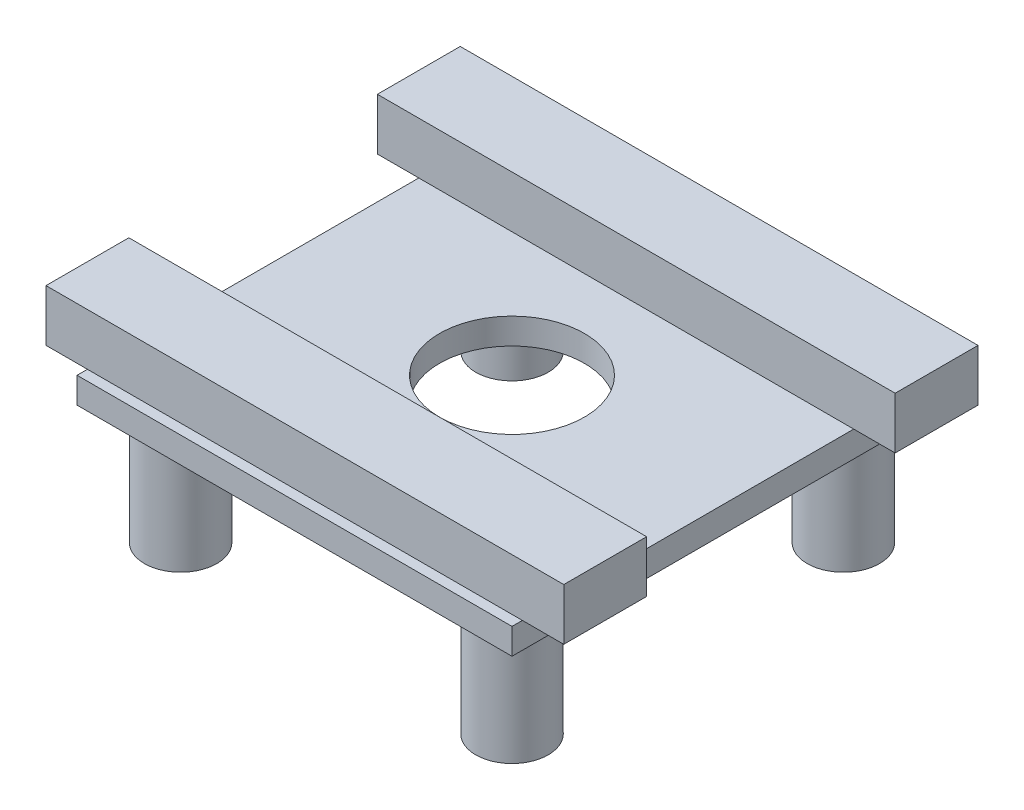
ISO-10303-21;
HEADER;
FILE_DESCRIPTION(('STEP AP214'),'2;1');
FILE_NAME('part.step','',(''),(''),'','','');
FILE_SCHEMA(('AUTOMOTIVE_DESIGN { 1 0 10303 214 1 1 1 1 }'));
ENDSEC;
DATA;
#1=APPLICATION_CONTEXT('core data for automotive mechanical design processes');
#2=APPLICATION_PROTOCOL_DEFINITION('international standard','automotive_design',2000,#1);
#3=PRODUCT_CONTEXT('',#1,'mechanical');
#4=PRODUCT('Part','Part','',(#3));
#5=PRODUCT_RELATED_PRODUCT_CATEGORY('part','',(#4));
#6=PRODUCT_DEFINITION_FORMATION('','',#4);
#7=PRODUCT_DEFINITION_CONTEXT('part definition',#1,'design');
#8=PRODUCT_DEFINITION('design','',#6,#7);
#9=PRODUCT_DEFINITION_SHAPE('','',#8);
#10=(LENGTH_UNIT() NAMED_UNIT(*) SI_UNIT(.MILLI.,.METRE.));
#11=(NAMED_UNIT(*) PLANE_ANGLE_UNIT() SI_UNIT($,.RADIAN.));
#12=(NAMED_UNIT(*) SI_UNIT($,.STERADIAN.) SOLID_ANGLE_UNIT());
#13=UNCERTAINTY_MEASURE_WITH_UNIT(LENGTH_MEASURE(1.E-05),#10,'distance_accuracy_value','');
#14=(GEOMETRIC_REPRESENTATION_CONTEXT(3) GLOBAL_UNCERTAINTY_ASSIGNED_CONTEXT((#13)) GLOBAL_UNIT_ASSIGNED_CONTEXT((#10,
#11,#12)) REPRESENTATION_CONTEXT('',''));
#15=CARTESIAN_POINT('',(0.,0.,0.));
#16=DIRECTION('',(0.,0.,1.));
#17=DIRECTION('',(1.,0.,0.));
#18=AXIS2_PLACEMENT_3D('',#15,#16,#17);
#19=CARTESIAN_POINT('',(0.,0.,0.));
#20=DIRECTION('',(0.,-1.,0.));
#21=DIRECTION('',(0.,0.,-1.));
#22=AXIS2_PLACEMENT_3D('',#19,#20,#21);
#23=PLANE('',#22);
#24=DIRECTION('',(-1.,0.,0.));
#25=VECTOR('',#24,1.);
#26=CARTESIAN_POINT('',(-50000.,0.,-40000.));
#27=LINE('',#26,#25);
#28=CARTESIAN_POINT('',(42000.,0.,-40000.));
#29=VERTEX_POINT('',#28);
#30=CARTESIAN_POINT('',(-42000.,0.,-40000.));
#31=VERTEX_POINT('',#30);
#32=EDGE_CURVE('E11',#29,#31,#27,.T.);
#33=ORIENTED_EDGE('',*,*,#32,.F.);
#34=DIRECTION('',(0.,0.,-1.));
#35=VECTOR('',#34,1.);
#36=CARTESIAN_POINT('',(42000.,0.,42000.));
#37=LINE('',#36,#35);
#38=CARTESIAN_POINT('',(42000.,0.,-42000.));
#39=VERTEX_POINT('',#38);
#40=EDGE_CURVE('E212',#29,#39,#37,.T.);
#41=ORIENTED_EDGE('',*,*,#40,.T.);
#42=DIRECTION('',(-1.,0.,0.));
#43=VECTOR('',#42,1.);
#44=CARTESIAN_POINT('',(-42000.,0.,-42000.));
#45=LINE('',#44,#43);
#46=CARTESIAN_POINT('',(-42000.,0.,-42000.));
#47=VERTEX_POINT('',#46);
#48=EDGE_CURVE('E197',#39,#47,#45,.T.);
#49=ORIENTED_EDGE('',*,*,#48,.T.);
#50=DIRECTION('',(0.,0.,1.));
#51=VECTOR('',#50,1.);
#52=CARTESIAN_POINT('',(-42000.,0.,42000.));
#53=LINE('',#52,#51);
#54=EDGE_CURVE('E210',#47,#31,#53,.T.);
#55=ORIENTED_EDGE('',*,*,#54,.T.);
#56=EDGE_LOOP('',(#33,#41,#49,#55));
#57=FACE_BOUND('',#56,.T.);
#58=ADVANCED_FACE('F39',(#57),#23,.F.);
#59=CARTESIAN_POINT('',(0.,0.,0.));
#60=DIRECTION('',(0.,1.,0.));
#61=DIRECTION('',(0.,0.,1.));
#62=AXIS2_PLACEMENT_3D('',#59,#60,#61);
#63=CIRCLE('',#62,14000.);
#64=CARTESIAN_POINT('',(0.,0.,14000.));
#65=VERTEX_POINT('',#64);
#66=EDGE_CURVE('E182',#65,#65,#63,.T.);
#67=ORIENTED_EDGE('',*,*,#66,.F.);
#68=EDGE_LOOP('',(#67));
#69=FACE_BOUND('',#68,.T.);
#70=DIRECTION('',(1.,0.,0.));
#71=VECTOR('',#70,1.);
#72=CARTESIAN_POINT('',(-50000.,0.,-24000.));
#73=LINE('',#72,#71);
#74=CARTESIAN_POINT('',(-42000.,0.,-24000.));
#75=VERTEX_POINT('',#74);
#76=CARTESIAN_POINT('',(42000.,0.,-24000.));
#77=VERTEX_POINT('',#76);
#78=EDGE_CURVE('E48',#75,#77,#73,.T.);
#79=ORIENTED_EDGE('',*,*,#78,.F.);
#80=CARTESIAN_POINT('',(-42000.,0.,24000.));
#81=VERTEX_POINT('',#80);
#82=EDGE_CURVE('E209',#75,#81,#53,.T.);
#83=ORIENTED_EDGE('',*,*,#82,.T.);
#84=DIRECTION('',(-1.,0.,0.));
#85=VECTOR('',#84,1.);
#86=CARTESIAN_POINT('',(-50000.,0.,24000.));
#87=LINE('',#86,#85);
#88=CARTESIAN_POINT('',(42000.,0.,24000.));
#89=VERTEX_POINT('',#88);
#90=EDGE_CURVE('E238',#89,#81,#87,.T.);
#91=ORIENTED_EDGE('',*,*,#90,.F.);
#92=EDGE_CURVE('E369',#89,#77,#37,.T.);
#93=ORIENTED_EDGE('',*,*,#92,.T.);
#94=EDGE_LOOP('',(#79,#83,#91,#93));
#95=FACE_BOUND('',#94,.T.);
#96=ADVANCED_FACE('F317',(#69,#95),#23,.F.);
#97=CARTESIAN_POINT('',(0.,0.,0.));
#98=DIRECTION('',(0.,-1.,0.));
#99=DIRECTION('',(0.,0.,-1.));
#100=AXIS2_PLACEMENT_3D('',#97,#98,#99);
#101=PLANE('',#100);
#102=CARTESIAN_POINT('',(-50000.,0.,24000.));
#103=VERTEX_POINT('',#102);
#104=EDGE_CURVE('E263',#81,#103,#87,.T.);
#105=ORIENTED_EDGE('',*,*,#104,.F.);
#106=CARTESIAN_POINT('',(-42000.,0.,40000.));
#107=VERTEX_POINT('',#106);
#108=EDGE_CURVE('E211',#81,#107,#53,.T.);
#109=ORIENTED_EDGE('',*,*,#108,.T.);
#110=DIRECTION('',(1.,0.,0.));
#111=VECTOR('',#110,1.);
#112=CARTESIAN_POINT('',(-50000.,0.,40000.));
#113=LINE('',#112,#111);
#114=CARTESIAN_POINT('',(-50000.,0.,40000.));
#115=VERTEX_POINT('',#114);
#116=EDGE_CURVE('E256',#115,#107,#113,.T.);
#117=ORIENTED_EDGE('',*,*,#116,.F.);
#118=DIRECTION('',(0.,0.,1.));
#119=VECTOR('',#118,1.);
#120=CARTESIAN_POINT('',(-50000.,0.,40000.));
#121=LINE('',#120,#119);
#122=EDGE_CURVE('E242',#103,#115,#121,.T.);
#123=ORIENTED_EDGE('',*,*,#122,.F.);
#124=EDGE_LOOP('',(#105,#109,#117,#123));
#125=FACE_BOUND('',#124,.T.);
#126=ADVANCED_FACE('F330',(#125),#101,.T.);
#127=CARTESIAN_POINT('',(42000.,0.,40000.));
#128=VERTEX_POINT('',#127);
#129=CARTESIAN_POINT('',(50000.,0.,40000.));
#130=VERTEX_POINT('',#129);
#131=EDGE_CURVE('E260',#128,#130,#113,.T.);
#132=ORIENTED_EDGE('',*,*,#131,.F.);
#133=EDGE_CURVE('E217',#128,#89,#37,.T.);
#134=ORIENTED_EDGE('',*,*,#133,.T.);
#135=CARTESIAN_POINT('',(50000.,0.,24000.));
#136=VERTEX_POINT('',#135);
#137=EDGE_CURVE('E249',#136,#89,#87,.T.);
#138=ORIENTED_EDGE('',*,*,#137,.F.);
#139=DIRECTION('',(0.,0.,-1.));
#140=VECTOR('',#139,1.);
#141=CARTESIAN_POINT('',(50000.,0.,40000.));
#142=LINE('',#141,#140);
#143=EDGE_CURVE('E261',#130,#136,#142,.T.);
#144=ORIENTED_EDGE('',*,*,#143,.F.);
#145=EDGE_LOOP('',(#132,#134,#138,#144));
#146=FACE_BOUND('',#145,.T.);
#147=ADVANCED_FACE('F375',(#146),#101,.T.);
#148=CARTESIAN_POINT('',(-50000.,10000.,40000.));
#149=DIRECTION('',(1.,0.,0.));
#150=DIRECTION('',(0.,0.,-1.));
#151=AXIS2_PLACEMENT_3D('',#148,#149,#150);
#152=PLANE('',#151);
#153=ORIENTED_EDGE('',*,*,#122,.T.);
#154=DIRECTION('',(0.,-1.,0.));
#155=VECTOR('',#154,1.);
#156=CARTESIAN_POINT('',(-50000.,10000.,40000.));
#157=LINE('',#156,#155);
#158=CARTESIAN_POINT('',(-50000.,10000.,40000.));
#159=VERTEX_POINT('',#158);
#160=EDGE_CURVE('E273',#159,#115,#157,.T.);
#161=ORIENTED_EDGE('',*,*,#160,.F.);
#162=DIRECTION('',(0.,0.,1.));
#163=VECTOR('',#162,1.);
#164=CARTESIAN_POINT('',(-50000.,10000.,40000.));
#165=LINE('',#164,#163);
#166=CARTESIAN_POINT('',(-50000.,10000.,24000.));
#167=VERTEX_POINT('',#166);
#168=EDGE_CURVE('E245',#167,#159,#165,.T.);
#169=ORIENTED_EDGE('',*,*,#168,.F.);
#170=DIRECTION('',(0.,-1.,0.));
#171=VECTOR('',#170,1.);
#172=CARTESIAN_POINT('',(-50000.,10000.,24000.));
#173=LINE('',#172,#171);
#174=EDGE_CURVE('E255',#167,#103,#173,.T.);
#175=ORIENTED_EDGE('',*,*,#174,.T.);
#176=EDGE_LOOP('',(#153,#161,#169,#175));
#177=FACE_BOUND('',#176,.T.);
#178=ADVANCED_FACE('F41',(#177),#152,.F.);
#179=CARTESIAN_POINT('',(-50000.,10000.,40000.));
#180=DIRECTION('',(0.,0.,-1.));
#181=DIRECTION('',(-1.,0.,0.));
#182=AXIS2_PLACEMENT_3D('',#179,#180,#181);
#183=PLANE('',#182);
#184=ORIENTED_EDGE('',*,*,#116,.T.);
#185=EDGE_CURVE('E224',#107,#128,#113,.T.);
#186=ORIENTED_EDGE('',*,*,#185,.T.);
#187=ORIENTED_EDGE('',*,*,#131,.T.);
#188=DIRECTION('',(0.,-1.,0.));
#189=VECTOR('',#188,1.);
#190=CARTESIAN_POINT('',(50000.,10000.,40000.));
#191=LINE('',#190,#189);
#192=CARTESIAN_POINT('',(50000.,10000.,40000.));
#193=VERTEX_POINT('',#192);
#194=EDGE_CURVE('E271',#193,#130,#191,.T.);
#195=ORIENTED_EDGE('',*,*,#194,.F.);
#196=DIRECTION('',(1.,0.,0.));
#197=VECTOR('',#196,1.);
#198=CARTESIAN_POINT('',(-50000.,10000.,40000.));
#199=LINE('',#198,#197);
#200=EDGE_CURVE('E250',#159,#193,#199,.T.);
#201=ORIENTED_EDGE('',*,*,#200,.F.);
#202=ORIENTED_EDGE('',*,*,#160,.T.);
#203=EDGE_LOOP('',(#184,#186,#187,#195,#201,#202));
#204=FACE_BOUND('',#203,.T.);
#205=ADVANCED_FACE('F360',(#204),#183,.F.);
#206=CARTESIAN_POINT('',(50000.,10000.,40000.));
#207=DIRECTION('',(-1.,0.,0.));
#208=DIRECTION('',(0.,0.,1.));
#209=AXIS2_PLACEMENT_3D('',#206,#207,#208);
#210=PLANE('',#209);
#211=ORIENTED_EDGE('',*,*,#143,.T.);
#212=DIRECTION('',(0.,-1.,0.));
#213=VECTOR('',#212,1.);
#214=CARTESIAN_POINT('',(50000.,10000.,24000.));
#215=LINE('',#214,#213);
#216=CARTESIAN_POINT('',(50000.,10000.,24000.));
#217=VERTEX_POINT('',#216);
#218=EDGE_CURVE('E268',#217,#136,#215,.T.);
#219=ORIENTED_EDGE('',*,*,#218,.F.);
#220=DIRECTION('',(0.,0.,-1.));
#221=VECTOR('',#220,1.);
#222=CARTESIAN_POINT('',(50000.,10000.,40000.));
#223=LINE('',#222,#221);
#224=EDGE_CURVE('E248',#193,#217,#223,.T.);
#225=ORIENTED_EDGE('',*,*,#224,.F.);
#226=ORIENTED_EDGE('',*,*,#194,.T.);
#227=EDGE_LOOP('',(#211,#219,#225,#226));
#228=FACE_BOUND('',#227,.T.);
#229=ADVANCED_FACE('F531',(#228),#210,.F.);
#230=CARTESIAN_POINT('',(-50000.,10000.,24000.));
#231=DIRECTION('',(0.,0.,1.));
#232=DIRECTION('',(1.,0.,0.));
#233=AXIS2_PLACEMENT_3D('',#230,#231,#232);
#234=PLANE('',#233);
#235=ORIENTED_EDGE('',*,*,#137,.T.);
#236=ORIENTED_EDGE('',*,*,#90,.T.);
#237=ORIENTED_EDGE('',*,*,#104,.T.);
#238=ORIENTED_EDGE('',*,*,#174,.F.);
#239=DIRECTION('',(-1.,0.,0.));
#240=VECTOR('',#239,1.);
#241=CARTESIAN_POINT('',(-50000.,10000.,24000.));
#242=LINE('',#241,#240);
#243=EDGE_CURVE('E252',#217,#167,#242,.T.);
#244=ORIENTED_EDGE('',*,*,#243,.F.);
#245=ORIENTED_EDGE('',*,*,#218,.T.);
#246=EDGE_LOOP('',(#235,#236,#237,#238,#244,#245));
#247=FACE_BOUND('',#246,.T.);
#248=ADVANCED_FACE('F364',(#247),#234,.F.);
#249=CARTESIAN_POINT('',(0.,10000.,0.));
#250=DIRECTION('',(0.,-1.,0.));
#251=DIRECTION('',(0.,0.,-1.));
#252=AXIS2_PLACEMENT_3D('',#249,#250,#251);
#253=PLANE('',#252);
#254=ORIENTED_EDGE('',*,*,#168,.T.);
#255=ORIENTED_EDGE('',*,*,#200,.T.);
#256=ORIENTED_EDGE('',*,*,#224,.T.);
#257=ORIENTED_EDGE('',*,*,#243,.T.);
#258=EDGE_LOOP('',(#254,#255,#256,#257));
#259=FACE_BOUND('',#258,.T.);
#260=ADVANCED_FACE('F522',(#259),#253,.F.);
#261=CARTESIAN_POINT('',(-42000.,-5000.,42000.));
#262=DIRECTION('',(-1.,0.,0.));
#263=DIRECTION('',(0.,0.,1.));
#264=AXIS2_PLACEMENT_3D('',#261,#262,#263);
#265=PLANE('',#264);
#266=ORIENTED_EDGE('',*,*,#54,.F.);
#267=DIRECTION('',(0.,1.,0.));
#268=VECTOR('',#267,1.);
#269=CARTESIAN_POINT('',(-42000.,-5000.,-42000.));
#270=LINE('',#269,#268);
#271=CARTESIAN_POINT('',(-42000.,-5000.,-42000.));
#272=VERTEX_POINT('',#271);
#273=EDGE_CURVE('E222',#272,#47,#270,.T.);
#274=ORIENTED_EDGE('',*,*,#273,.F.);
#275=DIRECTION('',(0.,0.,1.));
#276=VECTOR('',#275,1.);
#277=CARTESIAN_POINT('',(-42000.,-5000.,42000.));
#278=LINE('',#277,#276);
#279=CARTESIAN_POINT('',(-42000.,-5000.,42000.));
#280=VERTEX_POINT('',#279);
#281=EDGE_CURVE('E194',#272,#280,#278,.T.);
#282=ORIENTED_EDGE('',*,*,#281,.T.);
#283=DIRECTION('',(0.,1.,0.));
#284=VECTOR('',#283,1.);
#285=CARTESIAN_POINT('',(-42000.,-5000.,42000.));
#286=LINE('',#285,#284);
#287=CARTESIAN_POINT('',(-42000.,0.,42000.));
#288=VERTEX_POINT('',#287);
#289=EDGE_CURVE('E206',#280,#288,#286,.T.);
#290=ORIENTED_EDGE('',*,*,#289,.T.);
#291=EDGE_CURVE('E192',#107,#288,#53,.T.);
#292=ORIENTED_EDGE('',*,*,#291,.F.);
#293=ORIENTED_EDGE('',*,*,#108,.F.);
#294=ORIENTED_EDGE('',*,*,#82,.F.);
#295=EDGE_CURVE('E65',#31,#75,#53,.T.);
#296=ORIENTED_EDGE('',*,*,#295,.F.);
#297=EDGE_LOOP('',(#266,#274,#282,#290,#292,#293,#294,#296));
#298=FACE_BOUND('',#297,.T.);
#299=ADVANCED_FACE('F353',(#298),#265,.T.);
#300=CARTESIAN_POINT('',(-42000.,-5000.,-42000.));
#301=DIRECTION('',(0.,0.,-1.));
#302=DIRECTION('',(-1.,0.,0.));
#303=AXIS2_PLACEMENT_3D('',#300,#301,#302);
#304=PLANE('',#303);
#305=ORIENTED_EDGE('',*,*,#48,.F.);
#306=DIRECTION('',(0.,1.,0.));
#307=VECTOR('',#306,1.);
#308=CARTESIAN_POINT('',(42000.,-5000.,-42000.));
#309=LINE('',#308,#307);
#310=CARTESIAN_POINT('',(42000.,-5000.,-42000.));
#311=VERTEX_POINT('',#310);
#312=EDGE_CURVE('E221',#311,#39,#309,.T.);
#313=ORIENTED_EDGE('',*,*,#312,.F.);
#314=DIRECTION('',(-1.,0.,0.));
#315=VECTOR('',#314,1.);
#316=CARTESIAN_POINT('',(-42000.,-5000.,-42000.));
#317=LINE('',#316,#315);
#318=EDGE_CURVE('E201',#311,#272,#317,.T.);
#319=ORIENTED_EDGE('',*,*,#318,.T.);
#320=ORIENTED_EDGE('',*,*,#273,.T.);
#321=EDGE_LOOP('',(#305,#313,#319,#320));
#322=FACE_BOUND('',#321,.T.);
#323=ADVANCED_FACE('F387',(#322),#304,.T.);
#324=CARTESIAN_POINT('',(42000.,-5000.,42000.));
#325=DIRECTION('',(1.,0.,0.));
#326=DIRECTION('',(0.,0.,-1.));
#327=AXIS2_PLACEMENT_3D('',#324,#325,#326);
#328=PLANE('',#327);
#329=CARTESIAN_POINT('',(42000.,0.,42000.));
#330=VERTEX_POINT('',#329);
#331=EDGE_CURVE('E214',#330,#128,#37,.T.);
#332=ORIENTED_EDGE('',*,*,#331,.F.);
#333=DIRECTION('',(0.,1.,0.));
#334=VECTOR('',#333,1.);
#335=CARTESIAN_POINT('',(42000.,-5000.,42000.));
#336=LINE('',#335,#334);
#337=CARTESIAN_POINT('',(42000.,-5000.,42000.));
#338=VERTEX_POINT('',#337);
#339=EDGE_CURVE('E229',#338,#330,#336,.T.);
#340=ORIENTED_EDGE('',*,*,#339,.F.);
#341=DIRECTION('',(0.,0.,-1.));
#342=VECTOR('',#341,1.);
#343=CARTESIAN_POINT('',(42000.,-5000.,42000.));
#344=LINE('',#343,#342);
#345=EDGE_CURVE('E199',#338,#311,#344,.T.);
#346=ORIENTED_EDGE('',*,*,#345,.T.);
#347=ORIENTED_EDGE('',*,*,#312,.T.);
#348=ORIENTED_EDGE('',*,*,#40,.F.);
#349=EDGE_CURVE('E374',#77,#29,#37,.T.);
#350=ORIENTED_EDGE('',*,*,#349,.F.);
#351=ORIENTED_EDGE('',*,*,#92,.F.);
#352=ORIENTED_EDGE('',*,*,#133,.F.);
#353=EDGE_LOOP('',(#332,#340,#346,#347,#348,#350,#351,#352));
#354=FACE_BOUND('',#353,.T.);
#355=ADVANCED_FACE('F385',(#354),#328,.T.);
#356=CARTESIAN_POINT('',(-42000.,-5000.,42000.));
#357=DIRECTION('',(0.,0.,1.));
#358=DIRECTION('',(1.,0.,0.));
#359=AXIS2_PLACEMENT_3D('',#356,#357,#358);
#360=PLANE('',#359);
#361=DIRECTION('',(1.,0.,0.));
#362=VECTOR('',#361,1.);
#363=CARTESIAN_POINT('',(-42000.,0.,42000.));
#364=LINE('',#363,#362);
#365=EDGE_CURVE('E207',#288,#330,#364,.T.);
#366=ORIENTED_EDGE('',*,*,#365,.F.);
#367=ORIENTED_EDGE('',*,*,#289,.F.);
#368=DIRECTION('',(1.,0.,0.));
#369=VECTOR('',#368,1.);
#370=CARTESIAN_POINT('',(-42000.,-5000.,42000.));
#371=LINE('',#370,#369);
#372=EDGE_CURVE('E198',#280,#338,#371,.T.);
#373=ORIENTED_EDGE('',*,*,#372,.T.);
#374=ORIENTED_EDGE('',*,*,#339,.T.);
#375=EDGE_LOOP('',(#366,#367,#373,#374));
#376=FACE_BOUND('',#375,.T.);
#377=ADVANCED_FACE('F345',(#376),#360,.T.);
#378=CARTESIAN_POINT('',(0.,-5000.,0.));
#379=DIRECTION('',(0.,-1.,0.));
#380=DIRECTION('',(0.,0.,-1.));
#381=AXIS2_PLACEMENT_3D('',#378,#379,#380);
#382=PLANE('',#381);
#383=CARTESIAN_POINT('',(-32000.,-5000.,-32000.));
#384=DIRECTION('',(0.,-1.,0.));
#385=DIRECTION('',(0.,0.,-1.));
#386=AXIS2_PLACEMENT_3D('',#383,#384,#385);
#387=CIRCLE('',#386,7000.);
#388=CARTESIAN_POINT('',(-32000.,-5000.,-39000.));
#389=VERTEX_POINT('',#388);
#390=EDGE_CURVE('E43',#389,#389,#387,.T.);
#391=ORIENTED_EDGE('',*,*,#390,.F.);
#392=EDGE_LOOP('',(#391));
#393=FACE_BOUND('',#392,.T.);
#394=CARTESIAN_POINT('',(32000.,-5000.,-32000.));
#395=DIRECTION('',(0.,-1.,0.));
#396=DIRECTION('',(0.,0.,-1.));
#397=AXIS2_PLACEMENT_3D('',#394,#395,#396);
#398=CIRCLE('',#397,7000.);
#399=CARTESIAN_POINT('',(32000.,-5000.,-39000.));
#400=VERTEX_POINT('',#399);
#401=EDGE_CURVE('E231',#400,#400,#398,.T.);
#402=ORIENTED_EDGE('',*,*,#401,.F.);
#403=EDGE_LOOP('',(#402));
#404=FACE_BOUND('',#403,.T.);
#405=CARTESIAN_POINT('',(-32000.,-5000.,32000.));
#406=DIRECTION('',(0.,-1.,0.));
#407=DIRECTION('',(0.,0.,-1.));
#408=AXIS2_PLACEMENT_3D('',#405,#406,#407);
#409=CIRCLE('',#408,7000.);
#410=CARTESIAN_POINT('',(-32000.,-5000.,25000.));
#411=VERTEX_POINT('',#410);
#412=EDGE_CURVE('E232',#411,#411,#409,.F.);
#413=ORIENTED_EDGE('',*,*,#412,.T.);
#414=EDGE_LOOP('',(#413));
#415=FACE_BOUND('',#414,.T.);
#416=CARTESIAN_POINT('',(32000.,-5000.,32000.));
#417=DIRECTION('',(0.,-1.,0.));
#418=DIRECTION('',(0.,0.,-1.));
#419=AXIS2_PLACEMENT_3D('',#416,#417,#418);
#420=CIRCLE('',#419,7000.);
#421=CARTESIAN_POINT('',(32000.,-5000.,25000.));
#422=VERTEX_POINT('',#421);
#423=EDGE_CURVE('E233',#422,#422,#420,.F.);
#424=ORIENTED_EDGE('',*,*,#423,.T.);
#425=EDGE_LOOP('',(#424));
#426=FACE_BOUND('',#425,.T.);
#427=CARTESIAN_POINT('',(0.,-5000.,0.));
#428=DIRECTION('',(0.,1.,0.));
#429=DIRECTION('',(0.,0.,1.));
#430=AXIS2_PLACEMENT_3D('',#427,#428,#429);
#431=CIRCLE('',#430,14000.);
#432=CARTESIAN_POINT('',(0.,-5000.,14000.));
#433=VERTEX_POINT('',#432);
#434=EDGE_CURVE('E184',#433,#433,#431,.T.);
#435=ORIENTED_EDGE('',*,*,#434,.T.);
#436=EDGE_LOOP('',(#435));
#437=FACE_BOUND('',#436,.T.);
#438=ORIENTED_EDGE('',*,*,#281,.F.);
#439=ORIENTED_EDGE('',*,*,#318,.F.);
#440=ORIENTED_EDGE('',*,*,#345,.F.);
#441=ORIENTED_EDGE('',*,*,#372,.F.);
#442=EDGE_LOOP('',(#438,#439,#440,#441));
#443=FACE_BOUND('',#442,.T.);
#444=ADVANCED_FACE('F334',(#393,#404,#415,#426,#437,#443),#382,.T.);
#445=ORIENTED_EDGE('',*,*,#185,.F.);
#446=ORIENTED_EDGE('',*,*,#291,.T.);
#447=ORIENTED_EDGE('',*,*,#365,.T.);
#448=ORIENTED_EDGE('',*,*,#331,.T.);
#449=EDGE_LOOP('',(#445,#446,#447,#448));
#450=FACE_BOUND('',#449,.T.);
#451=ADVANCED_FACE('F325',(#450),#23,.F.);
#452=CARTESIAN_POINT('',(0.,-5000.,0.));
#453=DIRECTION('',(0.,1.,0.));
#454=DIRECTION('',(0.,0.,1.));
#455=AXIS2_PLACEMENT_3D('',#452,#453,#454);
#456=CYLINDRICAL_SURFACE('',#455,14000.);
#457=ORIENTED_EDGE('',*,*,#434,.F.);
#458=EDGE_LOOP('',(#457));
#459=FACE_BOUND('',#458,.T.);
#460=ORIENTED_EDGE('',*,*,#66,.T.);
#461=EDGE_LOOP('',(#460));
#462=FACE_BOUND('',#461,.T.);
#463=ADVANCED_FACE('F335',(#459,#462),#456,.F.);
#464=CARTESIAN_POINT('',(32000.,-28000.,32000.));
#465=DIRECTION('',(0.,1.,0.));
#466=DIRECTION('',(0.,0.,1.));
#467=AXIS2_PLACEMENT_3D('',#464,#465,#466);
#468=PLANE('',#467);
#469=CARTESIAN_POINT('',(32000.,-28000.,32000.));
#470=DIRECTION('',(0.,1.,0.));
#471=DIRECTION('',(0.,0.,1.));
#472=AXIS2_PLACEMENT_3D('',#469,#470,#471);
#473=CIRCLE('',#472,7000.);
#474=CARTESIAN_POINT('',(32000.,-28000.,39000.));
#475=VERTEX_POINT('',#474);
#476=EDGE_CURVE('E237',#475,#475,#473,.T.);
#477=ORIENTED_EDGE('',*,*,#476,.F.);
#478=EDGE_LOOP('',(#477));
#479=FACE_BOUND('',#478,.T.);
#480=ADVANCED_FACE('F340',(#479),#468,.F.);
#481=CARTESIAN_POINT('',(32000.,-28000.,32000.));
#482=DIRECTION('',(0.,1.,0.));
#483=DIRECTION('',(0.,0.,1.));
#484=AXIS2_PLACEMENT_3D('',#481,#482,#483);
#485=CYLINDRICAL_SURFACE('',#484,7000.);
#486=ORIENTED_EDGE('',*,*,#423,.F.);
#487=EDGE_LOOP('',(#486));
#488=FACE_BOUND('',#487,.T.);
#489=ORIENTED_EDGE('',*,*,#476,.T.);
#490=EDGE_LOOP('',(#489));
#491=FACE_BOUND('',#490,.T.);
#492=ADVANCED_FACE('F493',(#488,#491),#485,.T.);
#493=CARTESIAN_POINT('',(-32000.,-28000.,32000.));
#494=DIRECTION('',(0.,1.,0.));
#495=DIRECTION('',(0.,0.,1.));
#496=AXIS2_PLACEMENT_3D('',#493,#494,#495);
#497=PLANE('',#496);
#498=CARTESIAN_POINT('',(-32000.,-28000.,32000.));
#499=DIRECTION('',(0.,1.,0.));
#500=DIRECTION('',(0.,0.,1.));
#501=AXIS2_PLACEMENT_3D('',#498,#499,#500);
#502=CIRCLE('',#501,7000.);
#503=CARTESIAN_POINT('',(-32000.,-28000.,39000.));
#504=VERTEX_POINT('',#503);
#505=EDGE_CURVE('E239',#504,#504,#502,.T.);
#506=ORIENTED_EDGE('',*,*,#505,.F.);
#507=EDGE_LOOP('',(#506));
#508=FACE_BOUND('',#507,.T.);
#509=ADVANCED_FACE('F314',(#508),#497,.F.);
#510=CARTESIAN_POINT('',(-32000.,-28000.,32000.));
#511=DIRECTION('',(0.,1.,0.));
#512=DIRECTION('',(0.,0.,1.));
#513=AXIS2_PLACEMENT_3D('',#510,#511,#512);
#514=CYLINDRICAL_SURFACE('',#513,7000.);
#515=ORIENTED_EDGE('',*,*,#412,.F.);
#516=EDGE_LOOP('',(#515));
#517=FACE_BOUND('',#516,.T.);
#518=ORIENTED_EDGE('',*,*,#505,.T.);
#519=EDGE_LOOP('',(#518));
#520=FACE_BOUND('',#519,.T.);
#521=ADVANCED_FACE('F308',(#517,#520),#514,.T.);
#522=CARTESIAN_POINT('',(32000.,-28000.,-32000.));
#523=DIRECTION('',(0.,1.,0.));
#524=DIRECTION('',(0.,0.,1.));
#525=AXIS2_PLACEMENT_3D('',#522,#523,#524);
#526=PLANE('',#525);
#527=CARTESIAN_POINT('',(32000.,-28000.,-32000.));
#528=DIRECTION('',(0.,1.,0.));
#529=DIRECTION('',(0.,0.,1.));
#530=AXIS2_PLACEMENT_3D('',#527,#528,#529);
#531=CIRCLE('',#530,7000.);
#532=CARTESIAN_POINT('',(32000.,-28000.,-25000.));
#533=VERTEX_POINT('',#532);
#534=EDGE_CURVE('E291',#533,#533,#531,.T.);
#535=ORIENTED_EDGE('',*,*,#534,.F.);
#536=EDGE_LOOP('',(#535));
#537=FACE_BOUND('',#536,.T.);
#538=ADVANCED_FACE('F301',(#537),#526,.F.);
#539=CARTESIAN_POINT('',(32000.,-28000.,-32000.));
#540=DIRECTION('',(0.,1.,0.));
#541=DIRECTION('',(0.,0.,1.));
#542=AXIS2_PLACEMENT_3D('',#539,#540,#541);
#543=CYLINDRICAL_SURFACE('',#542,7000.);
#544=ORIENTED_EDGE('',*,*,#401,.T.);
#545=EDGE_LOOP('',(#544));
#546=FACE_BOUND('',#545,.T.);
#547=ORIENTED_EDGE('',*,*,#534,.T.);
#548=EDGE_LOOP('',(#547));
#549=FACE_BOUND('',#548,.T.);
#550=ADVANCED_FACE('F305',(#546,#549),#543,.T.);
#551=CARTESIAN_POINT('',(-32000.,-28000.,-32000.));
#552=DIRECTION('',(0.,1.,0.));
#553=DIRECTION('',(0.,0.,1.));
#554=AXIS2_PLACEMENT_3D('',#551,#552,#553);
#555=PLANE('',#554);
#556=CARTESIAN_POINT('',(-32000.,-28000.,-32000.));
#557=DIRECTION('',(0.,1.,0.));
#558=DIRECTION('',(0.,0.,1.));
#559=AXIS2_PLACEMENT_3D('',#556,#557,#558);
#560=CIRCLE('',#559,7000.);
#561=CARTESIAN_POINT('',(-32000.,-28000.,-25000.));
#562=VERTEX_POINT('',#561);
#563=EDGE_CURVE('E292',#562,#562,#560,.T.);
#564=ORIENTED_EDGE('',*,*,#563,.F.);
#565=EDGE_LOOP('',(#564));
#566=FACE_BOUND('',#565,.T.);
#567=ADVANCED_FACE('F315',(#566),#555,.F.);
#568=CARTESIAN_POINT('',(-32000.,-28000.,-32000.));
#569=DIRECTION('',(0.,1.,0.));
#570=DIRECTION('',(0.,0.,1.));
#571=AXIS2_PLACEMENT_3D('',#568,#569,#570);
#572=CYLINDRICAL_SURFACE('',#571,7000.);
#573=ORIENTED_EDGE('',*,*,#390,.T.);
#574=EDGE_LOOP('',(#573));
#575=FACE_BOUND('',#574,.T.);
#576=ORIENTED_EDGE('',*,*,#563,.T.);
#577=EDGE_LOOP('',(#576));
#578=FACE_BOUND('',#577,.T.);
#579=ADVANCED_FACE('F402',(#575,#578),#572,.T.);
#580=CARTESIAN_POINT('',(0.,0.,0.));
#581=DIRECTION('',(0.,-1.,0.));
#582=DIRECTION('',(0.,0.,-1.));
#583=AXIS2_PLACEMENT_3D('',#580,#581,#582);
#584=PLANE('',#583);
#585=CARTESIAN_POINT('',(50000.,0.,-24000.));
#586=VERTEX_POINT('',#585);
#587=EDGE_CURVE('E287',#77,#586,#73,.T.);
#588=ORIENTED_EDGE('',*,*,#587,.F.);
#589=ORIENTED_EDGE('',*,*,#349,.T.);
#590=CARTESIAN_POINT('',(50000.,0.,-40000.));
#591=VERTEX_POINT('',#590);
#592=EDGE_CURVE('E49',#591,#29,#27,.T.);
#593=ORIENTED_EDGE('',*,*,#592,.F.);
#594=DIRECTION('',(0.,0.,-1.));
#595=VECTOR('',#594,1.);
#596=CARTESIAN_POINT('',(50000.,0.,-24000.));
#597=LINE('',#596,#595);
#598=EDGE_CURVE('E286',#586,#591,#597,.T.);
#599=ORIENTED_EDGE('',*,*,#598,.F.);
#600=EDGE_LOOP('',(#588,#589,#593,#599));
#601=FACE_BOUND('',#600,.T.);
#602=ADVANCED_FACE('F396',(#601),#584,.T.);
#603=CARTESIAN_POINT('',(-50000.,10000.,-24000.));
#604=DIRECTION('',(1.,0.,0.));
#605=DIRECTION('',(0.,0.,-1.));
#606=AXIS2_PLACEMENT_3D('',#603,#604,#605);
#607=PLANE('',#606);
#608=DIRECTION('',(0.,0.,1.));
#609=VECTOR('',#608,1.);
#610=CARTESIAN_POINT('',(-50000.,0.,-24000.));
#611=LINE('',#610,#609);
#612=CARTESIAN_POINT('',(-50000.,0.,-40000.));
#613=VERTEX_POINT('',#612);
#614=CARTESIAN_POINT('',(-50000.,0.,-24000.));
#615=VERTEX_POINT('',#614);
#616=EDGE_CURVE('E178',#613,#615,#611,.T.);
#617=ORIENTED_EDGE('',*,*,#616,.T.);
#618=DIRECTION('',(0.,-1.,0.));
#619=VECTOR('',#618,1.);
#620=CARTESIAN_POINT('',(-50000.,10000.,-24000.));
#621=LINE('',#620,#619);
#622=CARTESIAN_POINT('',(-50000.,10000.,-24000.));
#623=VERTEX_POINT('',#622);
#624=EDGE_CURVE('E161',#623,#615,#621,.T.);
#625=ORIENTED_EDGE('',*,*,#624,.F.);
#626=DIRECTION('',(0.,0.,1.));
#627=VECTOR('',#626,1.);
#628=CARTESIAN_POINT('',(-50000.,10000.,-24000.));
#629=LINE('',#628,#627);
#630=CARTESIAN_POINT('',(-50000.,10000.,-40000.));
#631=VERTEX_POINT('',#630);
#632=EDGE_CURVE('E169',#631,#623,#629,.T.);
#633=ORIENTED_EDGE('',*,*,#632,.F.);
#634=DIRECTION('',(0.,-1.,0.));
#635=VECTOR('',#634,1.);
#636=CARTESIAN_POINT('',(-50000.,10000.,-40000.));
#637=LINE('',#636,#635);
#638=EDGE_CURVE('E299',#631,#613,#637,.T.);
#639=ORIENTED_EDGE('',*,*,#638,.T.);
#640=EDGE_LOOP('',(#617,#625,#633,#639));
#641=FACE_BOUND('',#640,.T.);
#642=ADVANCED_FACE('F179',(#641),#607,.F.);
#643=CARTESIAN_POINT('',(-50000.,10000.,-24000.));
#644=DIRECTION('',(0.,0.,-1.));
#645=DIRECTION('',(-1.,0.,0.));
#646=AXIS2_PLACEMENT_3D('',#643,#644,#645);
#647=PLANE('',#646);
#648=EDGE_CURVE('E281',#615,#75,#73,.T.);
#649=ORIENTED_EDGE('',*,*,#648,.T.);
#650=ORIENTED_EDGE('',*,*,#78,.T.);
#651=ORIENTED_EDGE('',*,*,#587,.T.);
#652=DIRECTION('',(0.,-1.,0.));
#653=VECTOR('',#652,1.);
#654=CARTESIAN_POINT('',(50000.,10000.,-24000.));
#655=LINE('',#654,#653);
#656=CARTESIAN_POINT('',(50000.,10000.,-24000.));
#657=VERTEX_POINT('',#656);
#658=EDGE_CURVE('E163',#657,#586,#655,.T.);
#659=ORIENTED_EDGE('',*,*,#658,.F.);
#660=DIRECTION('',(1.,0.,0.));
#661=VECTOR('',#660,1.);
#662=CARTESIAN_POINT('',(-50000.,10000.,-24000.));
#663=LINE('',#662,#661);
#664=EDGE_CURVE('E156',#623,#657,#663,.T.);
#665=ORIENTED_EDGE('',*,*,#664,.F.);
#666=ORIENTED_EDGE('',*,*,#624,.T.);
#667=EDGE_LOOP('',(#649,#650,#651,#659,#665,#666));
#668=FACE_BOUND('',#667,.T.);
#669=ADVANCED_FACE('F157',(#668),#647,.F.);
#670=CARTESIAN_POINT('',(50000.,10000.,-24000.));
#671=DIRECTION('',(-1.,0.,0.));
#672=DIRECTION('',(0.,0.,1.));
#673=AXIS2_PLACEMENT_3D('',#670,#671,#672);
#674=PLANE('',#673);
#675=ORIENTED_EDGE('',*,*,#598,.T.);
#676=DIRECTION('',(0.,-1.,0.));
#677=VECTOR('',#676,1.);
#678=CARTESIAN_POINT('',(50000.,10000.,-40000.));
#679=LINE('',#678,#677);
#680=CARTESIAN_POINT('',(50000.,10000.,-40000.));
#681=VERTEX_POINT('',#680);
#682=EDGE_CURVE('E188',#681,#591,#679,.T.);
#683=ORIENTED_EDGE('',*,*,#682,.F.);
#684=DIRECTION('',(0.,0.,-1.));
#685=VECTOR('',#684,1.);
#686=CARTESIAN_POINT('',(50000.,10000.,-24000.));
#687=LINE('',#686,#685);
#688=EDGE_CURVE('E170',#657,#681,#687,.T.);
#689=ORIENTED_EDGE('',*,*,#688,.F.);
#690=ORIENTED_EDGE('',*,*,#658,.T.);
#691=EDGE_LOOP('',(#675,#683,#689,#690));
#692=FACE_BOUND('',#691,.T.);
#693=ADVANCED_FACE('F399',(#692),#674,.F.);
#694=CARTESIAN_POINT('',(-50000.,10000.,-40000.));
#695=DIRECTION('',(0.,0.,1.));
#696=DIRECTION('',(1.,0.,0.));
#697=AXIS2_PLACEMENT_3D('',#694,#695,#696);
#698=PLANE('',#697);
#699=ORIENTED_EDGE('',*,*,#592,.T.);
#700=ORIENTED_EDGE('',*,*,#32,.T.);
#701=EDGE_CURVE('E51',#31,#613,#27,.T.);
#702=ORIENTED_EDGE('',*,*,#701,.T.);
#703=ORIENTED_EDGE('',*,*,#638,.F.);
#704=DIRECTION('',(-1.,0.,0.));
#705=VECTOR('',#704,1.);
#706=CARTESIAN_POINT('',(-50000.,10000.,-40000.));
#707=LINE('',#706,#705);
#708=EDGE_CURVE('E172',#681,#631,#707,.T.);
#709=ORIENTED_EDGE('',*,*,#708,.F.);
#710=ORIENTED_EDGE('',*,*,#682,.T.);
#711=EDGE_LOOP('',(#699,#700,#702,#703,#709,#710));
#712=FACE_BOUND('',#711,.T.);
#713=ADVANCED_FACE('F394',(#712),#698,.F.);
#714=CARTESIAN_POINT('',(0.,10000.,0.));
#715=DIRECTION('',(0.,-1.,0.));
#716=DIRECTION('',(0.,0.,-1.));
#717=AXIS2_PLACEMENT_3D('',#714,#715,#716);
#718=PLANE('',#717);
#719=ORIENTED_EDGE('',*,*,#632,.T.);
#720=ORIENTED_EDGE('',*,*,#664,.T.);
#721=ORIENTED_EDGE('',*,*,#688,.T.);
#722=ORIENTED_EDGE('',*,*,#708,.T.);
#723=EDGE_LOOP('',(#719,#720,#721,#722));
#724=FACE_BOUND('',#723,.T.);
#725=ADVANCED_FACE('F173',(#724),#718,.F.);
#726=ORIENTED_EDGE('',*,*,#701,.F.);
#727=ORIENTED_EDGE('',*,*,#295,.T.);
#728=ORIENTED_EDGE('',*,*,#648,.F.);
#729=ORIENTED_EDGE('',*,*,#616,.F.);
#730=EDGE_LOOP('',(#726,#727,#728,#729));
#731=FACE_BOUND('',#730,.T.);
#732=ADVANCED_FACE('F388',(#731),#584,.T.);
#733=CLOSED_SHELL('',(#58,#96,#126,#147,#178,#205,#229,#248,#260,#299,#323,#355,#377,#444,#451,
#463,#480,#492,#509,#521,#538,#550,#567,#579,#602,#642,#669,#693,#713,#725,#732));
#734=MANIFOLD_SOLID_BREP('B2',#733);
#735=ADVANCED_BREP_SHAPE_REPRESENTATION('',(#18,#734),#14);
#736=SHAPE_DEFINITION_REPRESENTATION(#9,#735);
ENDSEC;
END-ISO-10303-21;
